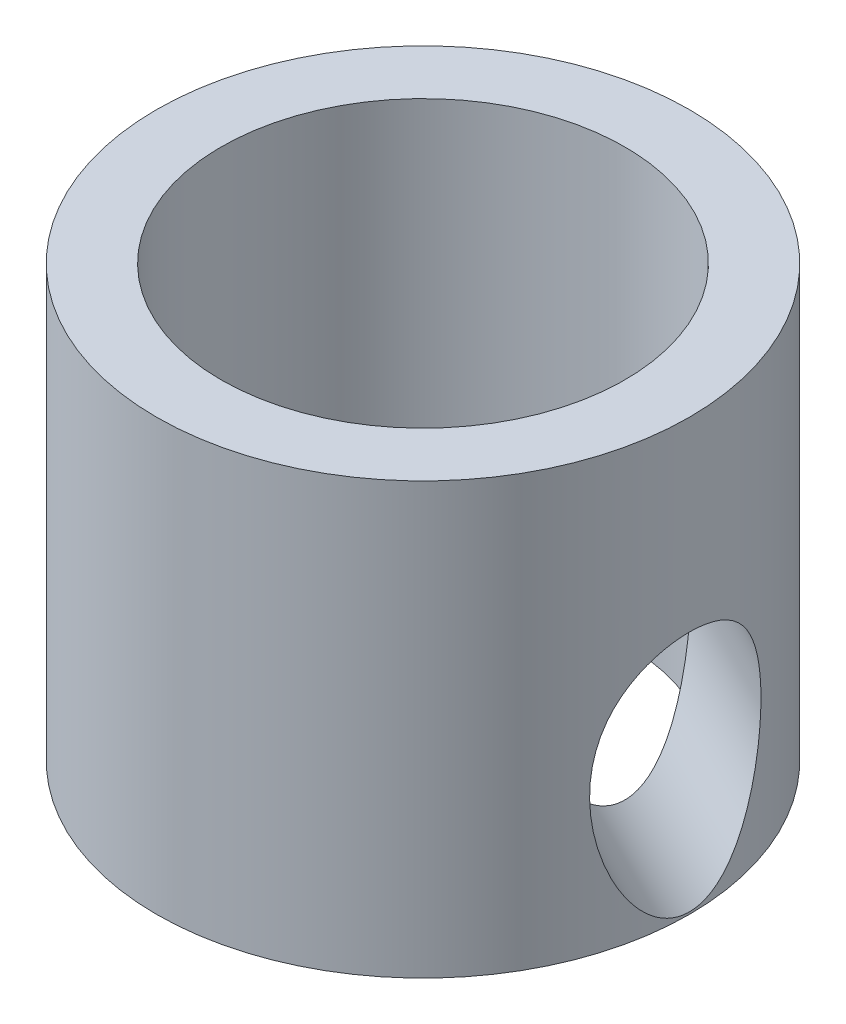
from build123d import *

# Parameters (mm, degrees)
SKETCH1_R               = 62.865
SKETCH1_R_2             = 47.625
BOSS_EXTRUDE1_DEPTH     = 101.6
CUT_EXTRUDE1_DEPTH      = 101.6
CUT_EXTRUDE1_DEPTH_BACK = 25.4
SKETCH3_R               = 20.2184


with BuildPart() as part:
    # Sketch1 → Boss-Extrude1 (new body)
    with BuildSketch(Plane(origin=(0, 0, 0), x_dir=(1, 0, 0), z_dir=(0, 1, 0))):
        with Locations(Location((0, 0, 0), (0, 0, 270))):
            Circle(SKETCH1_R)
        with Locations(Location((0, 0, 0), (0, 0, 270))):
            Circle(SKETCH1_R_2, mode=Mode.SUBTRACT)
    extrude(amount=BOSS_EXTRUDE1_DEPTH)

    # Sketch3 → Cut-Extrude1 (cut, two sides: drawn at the far end of the back side and taken through both)
    with BuildSketch(Plane(origin=(-19.05, 19.05, 0), x_dir=(0, 0, -1), z_dir=(0.7071067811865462, -0.7071067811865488, 0)).offset(-CUT_EXTRUDE1_DEPTH_BACK)):
        with Locations(Location((0, 65.040768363, 0), (0, 0, 90))):
            Circle(SKETCH3_R)
    extrude(amount=CUT_EXTRUDE1_DEPTH + CUT_EXTRUDE1_DEPTH_BACK, mode=Mode.SUBTRACT)


solid = part.part
